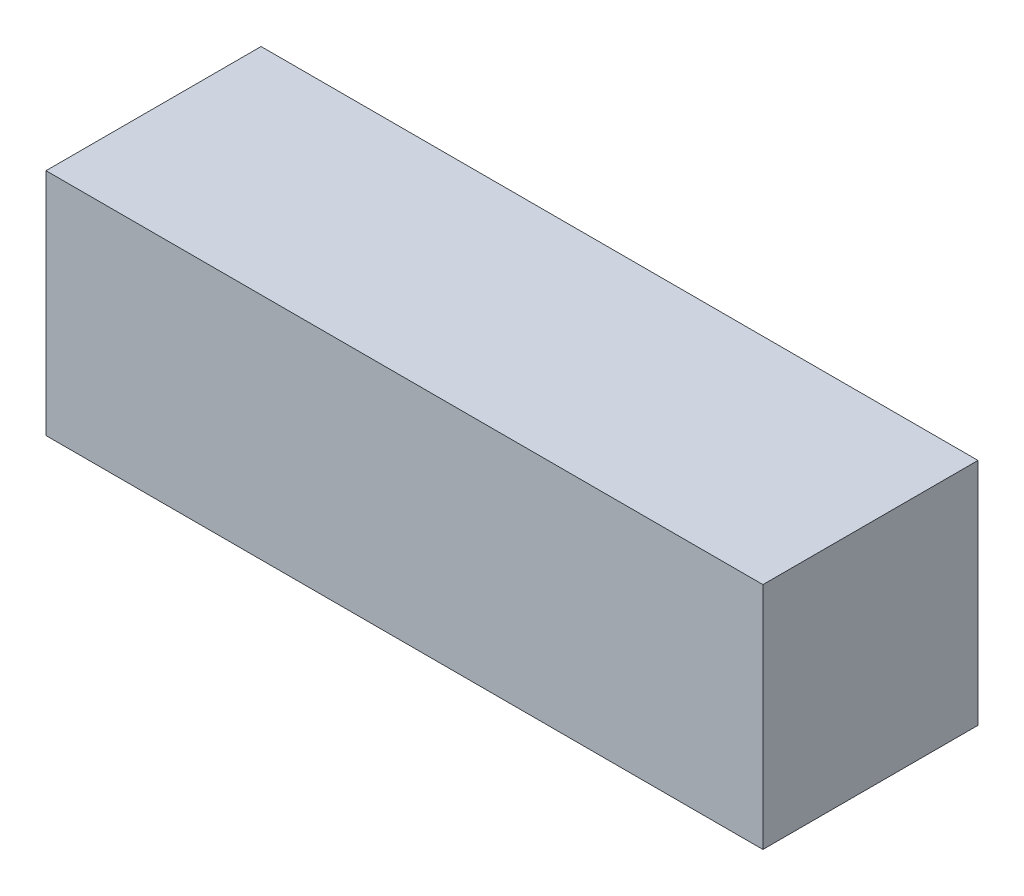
ISO-10303-21;
HEADER;
FILE_DESCRIPTION(('STEP AP214'),'2;1');
FILE_NAME('part.step','',(''),(''),'','','');
FILE_SCHEMA(('AUTOMOTIVE_DESIGN { 1 0 10303 214 1 1 1 1 }'));
ENDSEC;
DATA;
#1=APPLICATION_CONTEXT('core data for automotive mechanical design processes');
#2=APPLICATION_PROTOCOL_DEFINITION('international standard','automotive_design',2000,#1);
#3=PRODUCT_CONTEXT('',#1,'mechanical');
#4=PRODUCT('Part','Part','',(#3));
#5=PRODUCT_RELATED_PRODUCT_CATEGORY('part','',(#4));
#6=PRODUCT_DEFINITION_FORMATION('','',#4);
#7=PRODUCT_DEFINITION_CONTEXT('part definition',#1,'design');
#8=PRODUCT_DEFINITION('design','',#6,#7);
#9=PRODUCT_DEFINITION_SHAPE('','',#8);
#10=(LENGTH_UNIT() NAMED_UNIT(*) SI_UNIT(.MILLI.,.METRE.));
#11=(NAMED_UNIT(*) PLANE_ANGLE_UNIT() SI_UNIT($,.RADIAN.));
#12=(NAMED_UNIT(*) SI_UNIT($,.STERADIAN.) SOLID_ANGLE_UNIT());
#13=UNCERTAINTY_MEASURE_WITH_UNIT(LENGTH_MEASURE(1.E-05),#10,'distance_accuracy_value','');
#14=(GEOMETRIC_REPRESENTATION_CONTEXT(3) GLOBAL_UNCERTAINTY_ASSIGNED_CONTEXT((#13)) GLOBAL_UNIT_ASSIGNED_CONTEXT((#10,
#11,#12)) REPRESENTATION_CONTEXT('',''));
#15=CARTESIAN_POINT('',(0.,0.,0.));
#16=DIRECTION('',(0.,0.,1.));
#17=DIRECTION('',(1.,0.,0.));
#18=AXIS2_PLACEMENT_3D('',#15,#16,#17);
#19=CARTESIAN_POINT('',(0.,0.,3.));
#20=DIRECTION('',(1.,0.,0.));
#21=DIRECTION('',(0.,0.,-1.));
#22=AXIS2_PLACEMENT_3D('',#19,#20,#21);
#23=PLANE('',#22);
#24=DIRECTION('',(0.,-1.,0.));
#25=VECTOR('',#24,1.);
#26=CARTESIAN_POINT('',(0.,0.,0.));
#27=LINE('',#26,#25);
#28=CARTESIAN_POINT('',(0.,3.2,0.));
#29=VERTEX_POINT('',#28);
#30=CARTESIAN_POINT('',(0.,0.,0.));
#31=VERTEX_POINT('',#30);
#32=EDGE_CURVE('E103',#29,#31,#27,.T.);
#33=ORIENTED_EDGE('',*,*,#32,.T.);
#34=DIRECTION('',(0.,0.,-1.));
#35=VECTOR('',#34,1.);
#36=CARTESIAN_POINT('',(0.,0.,3.));
#37=LINE('',#36,#35);
#38=CARTESIAN_POINT('',(0.,0.,3.));
#39=VERTEX_POINT('',#38);
#40=EDGE_CURVE('E11',#39,#31,#37,.T.);
#41=ORIENTED_EDGE('',*,*,#40,.F.);
#42=DIRECTION('',(0.,-1.,0.));
#43=VECTOR('',#42,1.);
#44=CARTESIAN_POINT('',(0.,0.,3.));
#45=LINE('',#44,#43);
#46=CARTESIAN_POINT('',(0.,3.2,3.));
#47=VERTEX_POINT('',#46);
#48=EDGE_CURVE('E91',#47,#39,#45,.T.);
#49=ORIENTED_EDGE('',*,*,#48,.F.);
#50=DIRECTION('',(0.,0.,-1.));
#51=VECTOR('',#50,1.);
#52=CARTESIAN_POINT('',(0.,3.2,3.));
#53=LINE('',#52,#51);
#54=EDGE_CURVE('E99',#47,#29,#53,.T.);
#55=ORIENTED_EDGE('',*,*,#54,.T.);
#56=EDGE_LOOP('',(#33,#41,#49,#55));
#57=FACE_BOUND('',#56,.T.);
#58=ADVANCED_FACE('F40',(#57),#23,.F.);
#59=CARTESIAN_POINT('',(0.,0.,3.));
#60=DIRECTION('',(0.,1.,0.));
#61=DIRECTION('',(0.,0.,1.));
#62=AXIS2_PLACEMENT_3D('',#59,#60,#61);
#63=PLANE('',#62);
#64=DIRECTION('',(1.,0.,0.));
#65=VECTOR('',#64,1.);
#66=CARTESIAN_POINT('',(0.,0.,0.));
#67=LINE('',#66,#65);
#68=CARTESIAN_POINT('',(10.,0.,0.));
#69=VERTEX_POINT('',#68);
#70=EDGE_CURVE('E95',#31,#69,#67,.T.);
#71=ORIENTED_EDGE('',*,*,#70,.T.);
#72=DIRECTION('',(0.,0.,-1.));
#73=VECTOR('',#72,1.);
#74=CARTESIAN_POINT('',(10.,0.,3.));
#75=LINE('',#74,#73);
#76=CARTESIAN_POINT('',(10.,0.,3.));
#77=VERTEX_POINT('',#76);
#78=EDGE_CURVE('E48',#77,#69,#75,.T.);
#79=ORIENTED_EDGE('',*,*,#78,.F.);
#80=DIRECTION('',(1.,0.,0.));
#81=VECTOR('',#80,1.);
#82=CARTESIAN_POINT('',(0.,0.,3.));
#83=LINE('',#82,#81);
#84=EDGE_CURVE('E86',#39,#77,#83,.T.);
#85=ORIENTED_EDGE('',*,*,#84,.F.);
#86=ORIENTED_EDGE('',*,*,#40,.T.);
#87=EDGE_LOOP('',(#71,#79,#85,#86));
#88=FACE_BOUND('',#87,.T.);
#89=ADVANCED_FACE('F94',(#88),#63,.F.);
#90=CARTESIAN_POINT('',(10.,0.,3.));
#91=DIRECTION('',(-1.,0.,0.));
#92=DIRECTION('',(0.,0.,1.));
#93=AXIS2_PLACEMENT_3D('',#90,#91,#92);
#94=PLANE('',#93);
#95=DIRECTION('',(0.,1.,0.));
#96=VECTOR('',#95,1.);
#97=CARTESIAN_POINT('',(10.,0.,0.));
#98=LINE('',#97,#96);
#99=CARTESIAN_POINT('',(10.,3.2,0.));
#100=VERTEX_POINT('',#99);
#101=EDGE_CURVE('E73',#69,#100,#98,.T.);
#102=ORIENTED_EDGE('',*,*,#101,.T.);
#103=DIRECTION('',(0.,0.,-1.));
#104=VECTOR('',#103,1.);
#105=CARTESIAN_POINT('',(10.,3.2,3.));
#106=LINE('',#105,#104);
#107=CARTESIAN_POINT('',(10.,3.2,3.));
#108=VERTEX_POINT('',#107);
#109=EDGE_CURVE('E96',#108,#100,#106,.T.);
#110=ORIENTED_EDGE('',*,*,#109,.F.);
#111=DIRECTION('',(0.,1.,0.));
#112=VECTOR('',#111,1.);
#113=CARTESIAN_POINT('',(10.,0.,3.));
#114=LINE('',#113,#112);
#115=EDGE_CURVE('E89',#77,#108,#114,.T.);
#116=ORIENTED_EDGE('',*,*,#115,.F.);
#117=ORIENTED_EDGE('',*,*,#78,.T.);
#118=EDGE_LOOP('',(#102,#110,#116,#117));
#119=FACE_BOUND('',#118,.T.);
#120=ADVANCED_FACE('F97',(#119),#94,.F.);
#121=CARTESIAN_POINT('',(0.,3.2,3.));
#122=DIRECTION('',(0.,-1.,0.));
#123=DIRECTION('',(0.,0.,-1.));
#124=AXIS2_PLACEMENT_3D('',#121,#122,#123);
#125=PLANE('',#124);
#126=DIRECTION('',(-1.,0.,0.));
#127=VECTOR('',#126,1.);
#128=CARTESIAN_POINT('',(0.,3.2,0.));
#129=LINE('',#128,#127);
#130=EDGE_CURVE('E79',#100,#29,#129,.T.);
#131=ORIENTED_EDGE('',*,*,#130,.T.);
#132=ORIENTED_EDGE('',*,*,#54,.F.);
#133=DIRECTION('',(-1.,0.,0.));
#134=VECTOR('',#133,1.);
#135=CARTESIAN_POINT('',(0.,3.2,3.));
#136=LINE('',#135,#134);
#137=EDGE_CURVE('E56',#108,#47,#136,.T.);
#138=ORIENTED_EDGE('',*,*,#137,.F.);
#139=ORIENTED_EDGE('',*,*,#109,.T.);
#140=EDGE_LOOP('',(#131,#132,#138,#139));
#141=FACE_BOUND('',#140,.T.);
#142=ADVANCED_FACE('F110',(#141),#125,.F.);
#143=CARTESIAN_POINT('',(0.,0.,3.));
#144=DIRECTION('',(0.,0.,-1.));
#145=DIRECTION('',(-1.,0.,0.));
#146=AXIS2_PLACEMENT_3D('',#143,#144,#145);
#147=PLANE('',#146);
#148=ORIENTED_EDGE('',*,*,#48,.T.);
#149=ORIENTED_EDGE('',*,*,#84,.T.);
#150=ORIENTED_EDGE('',*,*,#115,.T.);
#151=ORIENTED_EDGE('',*,*,#137,.T.);
#152=EDGE_LOOP('',(#148,#149,#150,#151));
#153=FACE_BOUND('',#152,.T.);
#154=ADVANCED_FACE('F87',(#153),#147,.F.);
#155=CARTESIAN_POINT('',(0.,0.,0.));
#156=DIRECTION('',(0.,0.,-1.));
#157=DIRECTION('',(-1.,0.,0.));
#158=AXIS2_PLACEMENT_3D('',#155,#156,#157);
#159=PLANE('',#158);
#160=ORIENTED_EDGE('',*,*,#32,.F.);
#161=ORIENTED_EDGE('',*,*,#130,.F.);
#162=ORIENTED_EDGE('',*,*,#101,.F.);
#163=ORIENTED_EDGE('',*,*,#70,.F.);
#164=EDGE_LOOP('',(#160,#161,#162,#163));
#165=FACE_BOUND('',#164,.T.);
#166=ADVANCED_FACE('F113',(#165),#159,.T.);
#167=CLOSED_SHELL('',(#58,#89,#120,#142,#154,#166));
#168=MANIFOLD_SOLID_BREP('B2',#167);
#169=ADVANCED_BREP_SHAPE_REPRESENTATION('',(#18,#168),#14);
#170=SHAPE_DEFINITION_REPRESENTATION(#9,#169);
ENDSEC;
END-ISO-10303-21;
